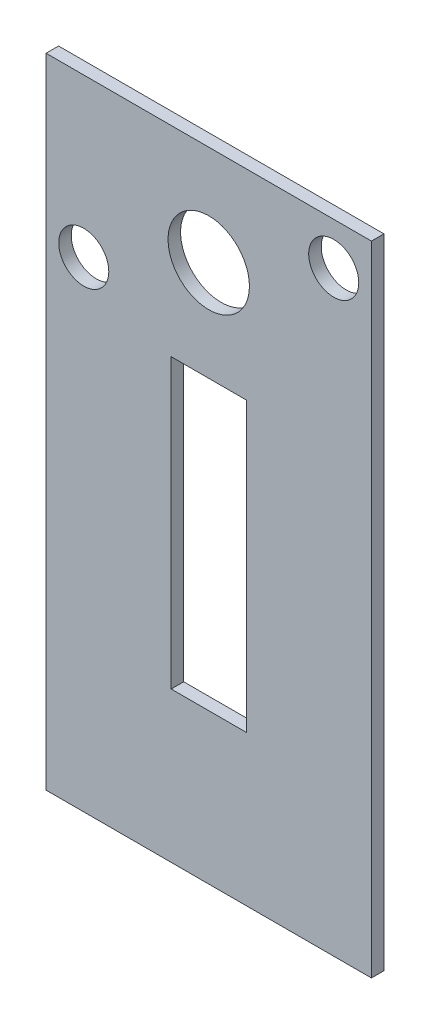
from build123d import *

# Parameters (mm, degrees)
BASE_EXTRUSION_DEPTH      = 0.25
BASE_EXTRUSION_DEPTH_BACK = 0.25
ESQUISSE1_W               = 13
ESQUISSE1_H               = 25.5
ESQUISSE1_R               = 1
ESQUISSE1_R_2             = 1.625
ESQUISSE2_W               = 3
ESQUISSE2_H               = 11.5
ENL_V_MAT_EXTRU_1_DEPTH   = 37.093628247


with BuildPart() as part:
    # Esquisse1 → Base-Extrusion (new, two sides: drawn at the far end of the back side and taken through both)
    with BuildSketch(Plane.XY.offset(-BASE_EXTRUSION_DEPTH_BACK)):
        with Locations((0, -22.75)):
            Rectangle(ESQUISSE1_W, ESQUISSE1_H)
        with Locations((-4.993776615, -16.304819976)):
            Circle(ESQUISSE1_R, mode=Mode.SUBTRACT)
        with Locations((0, -14)):
            Circle(ESQUISSE1_R_2, mode=Mode.SUBTRACT)
        with Locations((4.993776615, -11.695180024)):
            Circle(ESQUISSE1_R, mode=Mode.SUBTRACT)
    extrude(amount=BASE_EXTRUSION_DEPTH + BASE_EXTRUSION_DEPTH_BACK)

    # Esquisse2 → Enl_v. mat.-Extru.1 (cut, through all)
    with BuildSketch(Plane(origin=(0, 0, -0.25), x_dir=(-1, 0, 0), z_dir=(0, 0, -1))):
        with Locations((0, -23.75)):
            Rectangle(ESQUISSE2_W, ESQUISSE2_H)
    extrude(amount=-ENL_V_MAT_EXTRU_1_DEPTH, mode=Mode.SUBTRACT)


solid = part.part
